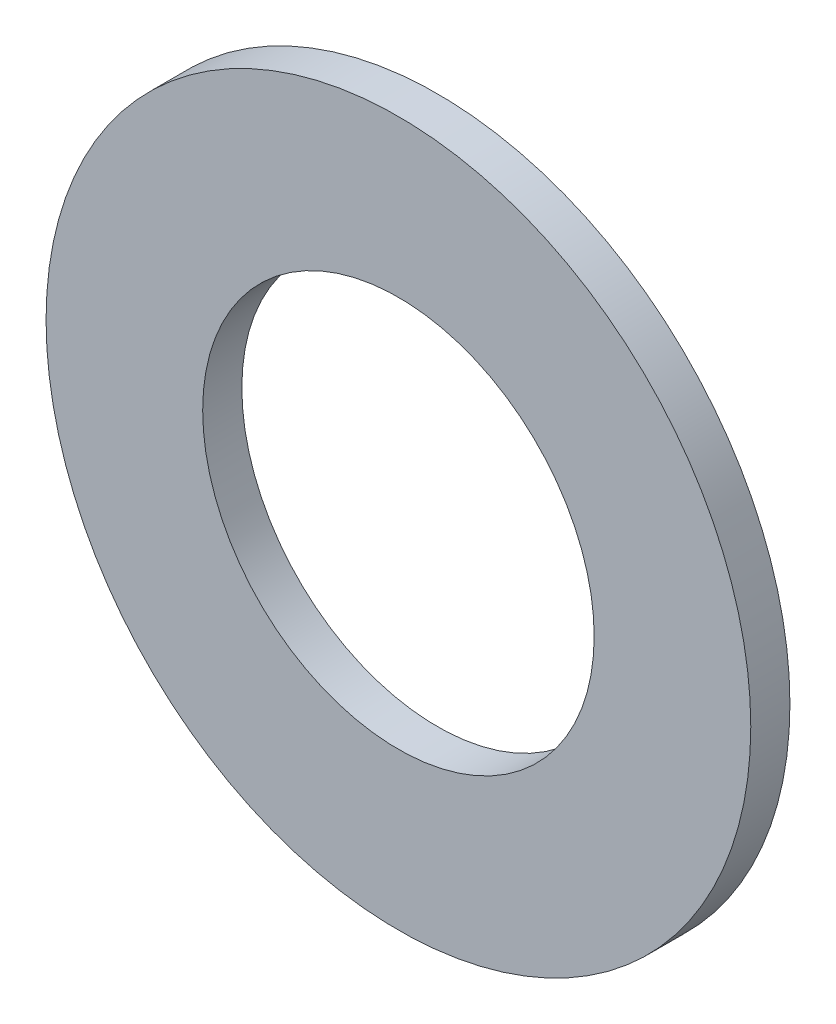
from build123d import *

# Parameters (mm, degrees)
ESQUISSE1_R             = 18
BASE_EXTRUSION_DEPTH    = 2
ESQUISSE2_R             = 10
ENL_V_MAT_EXTRU_1_DEPTH = 2


with BuildPart() as part:
    # Esquisse1 → Base-Extrusion (new body)
    with BuildSketch(Plane.XY):
        with Locations(Location((0, 0, 0), (0, 0, 180))):
            Circle(ESQUISSE1_R)
    extrude(amount=BASE_EXTRUSION_DEPTH)

    # Esquisse2 → Enl_v. mat.-Extru.1 (cut)
    with BuildSketch(Plane.XY.offset(2)):
        Circle(ESQUISSE2_R)
    extrude(amount=-ENL_V_MAT_EXTRU_1_DEPTH, mode=Mode.SUBTRACT)


solid = part.part
